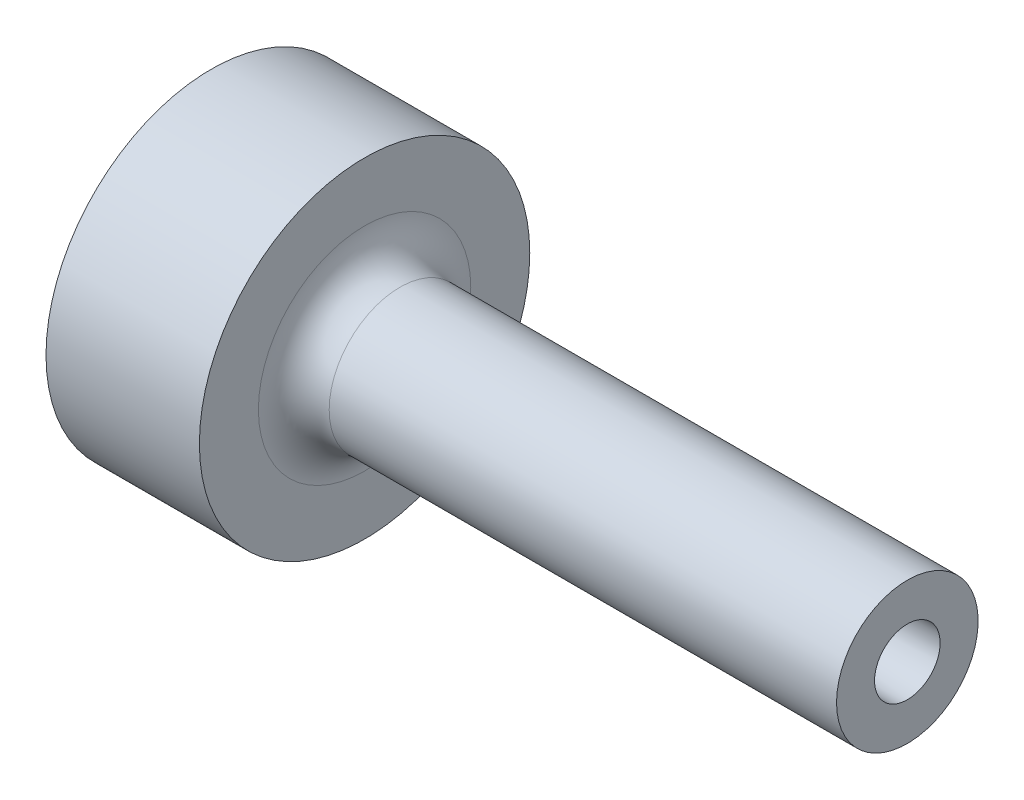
ISO-10303-21;
HEADER;
FILE_DESCRIPTION(('STEP AP214'),'2;1');
FILE_NAME('part.step','',(''),(''),'','','');
FILE_SCHEMA(('AUTOMOTIVE_DESIGN { 1 0 10303 214 1 1 1 1 }'));
ENDSEC;
DATA;
#1=APPLICATION_CONTEXT('core data for automotive mechanical design processes');
#2=APPLICATION_PROTOCOL_DEFINITION('international standard','automotive_design',2000,#1);
#3=PRODUCT_CONTEXT('',#1,'mechanical');
#4=PRODUCT('Part','Part','',(#3));
#5=PRODUCT_RELATED_PRODUCT_CATEGORY('part','',(#4));
#6=PRODUCT_DEFINITION_FORMATION('','',#4);
#7=PRODUCT_DEFINITION_CONTEXT('part definition',#1,'design');
#8=PRODUCT_DEFINITION('design','',#6,#7);
#9=PRODUCT_DEFINITION_SHAPE('','',#8);
#10=(LENGTH_UNIT() NAMED_UNIT(*) SI_UNIT(.MILLI.,.METRE.));
#11=(NAMED_UNIT(*) PLANE_ANGLE_UNIT() SI_UNIT($,.RADIAN.));
#12=(NAMED_UNIT(*) SI_UNIT($,.STERADIAN.) SOLID_ANGLE_UNIT());
#13=UNCERTAINTY_MEASURE_WITH_UNIT(LENGTH_MEASURE(1.E-05),#10,'distance_accuracy_value','');
#14=(GEOMETRIC_REPRESENTATION_CONTEXT(3) GLOBAL_UNCERTAINTY_ASSIGNED_CONTEXT((#13)) GLOBAL_UNIT_ASSIGNED_CONTEXT((#10,
#11,#12)) REPRESENTATION_CONTEXT('',''));
#15=CARTESIAN_POINT('',(0.,0.,0.));
#16=DIRECTION('',(0.,0.,1.));
#17=DIRECTION('',(1.,0.,0.));
#18=AXIS2_PLACEMENT_3D('',#15,#16,#17);
#19=CARTESIAN_POINT('',(0.,0.,0.));
#20=DIRECTION('',(-1.,0.,0.));
#21=DIRECTION('',(0.,0.,1.));
#22=AXIS2_PLACEMENT_3D('',#19,#20,#21);
#23=CYLINDRICAL_SURFACE('',#22,14.);
#24=CARTESIAN_POINT('',(13.,0.,0.));
#25=DIRECTION('',(-1.,0.,0.));
#26=DIRECTION('',(0.,0.,1.));
#27=AXIS2_PLACEMENT_3D('',#24,#25,#26);
#28=CIRCLE('',#27,14.);
#29=CARTESIAN_POINT('',(13.,0.,14.));
#30=VERTEX_POINT('',#29);
#31=EDGE_CURVE('E89',#30,#30,#28,.T.);
#32=ORIENTED_EDGE('',*,*,#31,.T.);
#33=EDGE_LOOP('',(#32));
#34=FACE_BOUND('',#33,.T.);
#35=CARTESIAN_POINT('',(0.,0.,0.));
#36=DIRECTION('',(-1.,0.,0.));
#37=DIRECTION('',(0.,0.,1.));
#38=AXIS2_PLACEMENT_3D('',#35,#36,#37);
#39=CIRCLE('',#38,14.);
#40=CARTESIAN_POINT('',(0.,0.,14.));
#41=VERTEX_POINT('',#40);
#42=EDGE_CURVE('E84',#41,#41,#39,.T.);
#43=ORIENTED_EDGE('',*,*,#42,.F.);
#44=EDGE_LOOP('',(#43));
#45=FACE_BOUND('',#44,.T.);
#46=CARTESIAN_POINT('',(6.5,-13.856406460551,-2.));
#47=CARTESIAN_POINT('',(6.61172417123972,-13.8564082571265,-1.99999534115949));
#48=CARTESIAN_POINT('',(6.72351471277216,-13.8577723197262,-1.99060664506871));
#49=CARTESIAN_POINT('',(6.9439746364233,-13.8630779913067,-1.95330740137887));
#50=CARTESIAN_POINT('',(7.05264079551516,-13.8670221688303,-1.92537839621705));
#51=CARTESIAN_POINT('',(7.26362870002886,-13.8770324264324,-1.85184738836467));
#52=CARTESIAN_POINT('',(7.36595507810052,-13.8830969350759,-1.80625847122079));
#53=CARTESIAN_POINT('',(7.56148972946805,-13.8966626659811,-1.69873175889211));
#54=CARTESIAN_POINT('',(7.65469934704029,-13.9041636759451,-1.63679637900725));
#55=CARTESIAN_POINT('',(7.83004829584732,-13.9198182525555,-1.49785346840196));
#56=CARTESIAN_POINT('',(7.91211171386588,-13.9279757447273,-1.42075056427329));
#57=CARTESIAN_POINT('',(8.06218155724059,-13.9439890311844,-1.25386707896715));
#58=CARTESIAN_POINT('',(8.13018723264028,-13.9518448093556,-1.16408582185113));
#59=CARTESIAN_POINT('',(8.25048909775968,-13.9664103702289,-0.973910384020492));
#60=CARTESIAN_POINT('',(8.30271571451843,-13.9731150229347,-0.873471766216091));
#61=CARTESIAN_POINT('',(8.38953073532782,-13.9845795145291,-0.665136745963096));
#62=CARTESIAN_POINT('',(8.4241199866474,-13.9893394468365,-0.557240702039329));
#63=CARTESIAN_POINT('',(8.47444920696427,-13.9963505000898,-0.337834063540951));
#64=CARTESIAN_POINT('',(8.49031606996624,-13.9986185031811,-0.226353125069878));
#65=CARTESIAN_POINT('',(8.5031438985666,-14.0004479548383,-0.00228956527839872));
#66=CARTESIAN_POINT('',(8.50010582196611,-14.0000095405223,0.110292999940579));
#67=CARTESIAN_POINT('',(8.47531062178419,-13.9964890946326,0.33249899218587));
#68=CARTESIAN_POINT('',(8.45369000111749,-13.9934263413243,0.442137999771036));
#69=CARTESIAN_POINT('',(8.39255744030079,-13.9850228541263,0.656215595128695));
#70=CARTESIAN_POINT('',(8.3530450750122,-13.9796820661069,0.760654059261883));
#71=CARTESIAN_POINT('',(8.25710925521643,-13.9672894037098,0.961781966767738));
#72=CARTESIAN_POINT('',(8.20062784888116,-13.9602316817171,1.05844339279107));
#73=CARTESIAN_POINT('',(8.07239950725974,-13.9451926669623,1.24096782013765));
#74=CARTESIAN_POINT('',(8.00065165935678,-13.9372113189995,1.32683017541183));
#75=CARTESIAN_POINT('',(7.843165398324,-13.921132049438,1.48612299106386));
#76=CARTESIAN_POINT('',(7.75730786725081,-13.9130337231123,1.55943569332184));
#77=CARTESIAN_POINT('',(7.57444547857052,-13.8977029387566,1.69062989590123));
#78=CARTESIAN_POINT('',(7.47744056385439,-13.890470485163,1.74851131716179));
#79=CARTESIAN_POINT('',(7.27491971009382,-13.8776905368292,1.84721301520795));
#80=CARTESIAN_POINT('',(7.1693981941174,-13.8721441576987,1.88802200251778));
#81=CARTESIAN_POINT('',(6.95290242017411,-13.8633846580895,1.9513062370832));
#82=CARTESIAN_POINT('',(6.84192850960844,-13.8601713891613,1.97378265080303));
#83=CARTESIAN_POINT('',(6.61872346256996,-13.8564698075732,1.99960390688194));
#84=CARTESIAN_POINT('',(6.50651197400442,-13.8559577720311,2.00311531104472));
#85=CARTESIAN_POINT('',(6.28310219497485,-13.8576537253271,1.9913480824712));
#86=CARTESIAN_POINT('',(6.17190387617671,-13.8598616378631,1.9760699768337));
#87=CARTESIAN_POINT('',(5.95418781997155,-13.8667269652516,1.92729837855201));
#88=CARTESIAN_POINT('',(5.84765127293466,-13.8713733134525,1.8938871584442));
#89=CARTESIAN_POINT('',(5.6416912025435,-13.8825829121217,1.80988306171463));
#90=CARTESIAN_POINT('',(5.54226800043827,-13.8891462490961,1.75928940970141));
#91=CARTESIAN_POINT('',(5.35260812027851,-13.9035064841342,1.64195360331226));
#92=CARTESIAN_POINT('',(5.26243903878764,-13.911311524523,1.57510320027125));
#93=CARTESIAN_POINT('',(5.09454027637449,-13.9272509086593,1.42730277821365));
#94=CARTESIAN_POINT('',(5.01681123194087,-13.9353852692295,1.34635203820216));
#95=CARTESIAN_POINT('',(4.8754047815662,-13.9511405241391,1.17191708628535));
#96=CARTESIAN_POINT('',(4.81183747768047,-13.9587570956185,1.07834317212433));
#97=CARTESIAN_POINT('',(4.70132443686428,-13.972552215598,0.881748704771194));
#98=CARTESIAN_POINT('',(4.65437828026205,-13.9787308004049,0.778728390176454));
#99=CARTESIAN_POINT('',(4.57861788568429,-13.9889347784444,0.566515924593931));
#100=CARTESIAN_POINT('',(4.54974241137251,-13.9929674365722,0.457345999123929));
#101=CARTESIAN_POINT('',(4.51074453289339,-13.9984555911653,0.235645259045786));
#102=CARTESIAN_POINT('',(4.50062101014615,-13.9999112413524,0.123114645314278));
#103=CARTESIAN_POINT('',(4.49943976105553,-14.0000800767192,-0.101043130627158));
#104=CARTESIAN_POINT('',(4.50821318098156,-13.998817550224,-0.212669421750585));
#105=CARTESIAN_POINT('',(4.54421615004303,-13.9937406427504,-0.432842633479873));
#106=CARTESIAN_POINT('',(4.57144565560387,-13.989926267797,-0.541389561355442));
#107=CARTESIAN_POINT('',(4.6435299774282,-13.9801722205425,-0.752283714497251));
#108=CARTESIAN_POINT('',(4.68837418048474,-13.9742338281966,-0.854634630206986));
#109=CARTESIAN_POINT('',(4.79439714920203,-13.960885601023,-1.05038570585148));
#110=CARTESIAN_POINT('',(4.8555763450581,-13.9534757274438,-1.14378562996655));
#111=CARTESIAN_POINT('',(4.99314771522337,-13.9379304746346,-1.31984194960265));
#112=CARTESIAN_POINT('',(5.06966490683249,-13.9297894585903,-1.40240016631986));
#113=CARTESIAN_POINT('',(5.2354775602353,-13.9137422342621,-1.55356716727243));
#114=CARTESIAN_POINT('',(5.32477602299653,-13.9058360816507,-1.6221726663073));
#115=CARTESIAN_POINT('',(5.51414543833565,-13.8911108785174,-1.74379523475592));
#116=CARTESIAN_POINT('',(5.61426869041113,-13.8842975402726,-1.79673154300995));
#117=CARTESIAN_POINT('',(5.82203229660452,-13.8725962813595,-1.88495902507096));
#118=CARTESIAN_POINT('',(5.92966459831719,-13.8677063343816,-1.92026877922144));
#119=CARTESIAN_POINT('',(6.11483642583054,-13.8615529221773,-1.96409255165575));
#120=CARTESIAN_POINT('',(6.19122433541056,-13.859633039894,-1.97753762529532));
#121=CARTESIAN_POINT('',(6.34506419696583,-13.857059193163,-1.99549291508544));
#122=CARTESIAN_POINT('',(6.42251613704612,-13.8564052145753,-2.00000323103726));
#123=CARTESIAN_POINT('',(6.5,-13.856406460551,-2.));
#124=B_SPLINE_CURVE_WITH_KNOTS('',3,(#46,#47,#48,#49,#50,#51,#52,#53,#54,#55,#56,#57,#58,#59,
#60,#61,#62,#63,#64,#65,#66,#67,#68,#69,#70,#71,#72,#73,#74,#75,#76,#77,#78,#79,#80,#81,#82,#83,
#84,#85,#86,#87,#88,#89,#90,#91,#92,#93,#94,#95,#96,#97,#98,#99,#100,#101,#102,#103,#104,#105,
#106,#107,#108,#109,#110,#111,#112,#113,#114,#115,#116,#117,#118,#119,#120,#121,#122,#123),
.UNSPECIFIED.,.T.,.F.,(4,2,2,2,2,2,2,2,2,2,2,2,2,2,2,2,2,2,2,2,2,2,2,2,2,2,2,2,2,2,2,2,2,2,2,2,
2,2,4),(0.,0.334889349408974,0.670112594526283,1.00508792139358,1.34001378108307,
1.6771171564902,2.01423851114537,2.35282530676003,2.6913958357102,3.02765822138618,
3.36390357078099,3.69769984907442,4.03150405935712,4.36646147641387,4.70143892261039,
5.03940517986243,5.37737316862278,5.7155642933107,6.05373389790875,6.3889286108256,
6.72411392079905,7.05779100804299,7.39148315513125,7.72746121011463,8.06345644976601,
8.40197921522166,8.74049343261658,9.07785422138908,9.41519488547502,9.74953375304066,
10.083871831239,10.4180087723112,10.7521545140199,11.0891434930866,11.426211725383,
11.7649881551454,12.103406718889,12.3356645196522,12.5679197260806),.UNSPECIFIED.);
#125=CARTESIAN_POINT('',(6.5,-13.856406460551,-2.));
#126=VERTEX_POINT('',#125);
#127=EDGE_CURVE('E10',#126,#126,#124,.T.);
#128=ORIENTED_EDGE('',*,*,#127,.F.);
#129=EDGE_LOOP('',(#128));
#130=FACE_BOUND('',#129,.T.);
#131=ADVANCED_FACE('F16',(#34,#45,#130),#23,.T.);
#132=CARTESIAN_POINT('',(0.,0.,0.));
#133=DIRECTION('',(1.,0.,0.));
#134=DIRECTION('',(0.,0.,-1.));
#135=AXIS2_PLACEMENT_3D('',#132,#133,#134);
#136=CONICAL_SURFACE('',#135,1.75,0.0174532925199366);
#137=CARTESIAN_POINT('',(59.,0.,0.));
#138=DIRECTION('',(-1.,0.,0.));
#139=DIRECTION('',(0.,0.,1.));
#140=AXIS2_PLACEMENT_3D('',#137,#138,#139);
#141=CIRCLE('',#140,2.77984883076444);
#142=CARTESIAN_POINT('',(59.,0.,2.77984883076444));
#143=VERTEX_POINT('',#142);
#144=EDGE_CURVE('E81',#143,#143,#141,.T.);
#145=ORIENTED_EDGE('',*,*,#144,.F.);
#146=EDGE_LOOP('',(#145));
#147=FACE_BOUND('',#146,.T.);
#148=CARTESIAN_POINT('',(0.856894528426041,0.,0.));
#149=DIRECTION('',(-1.,0.,0.));
#150=DIRECTION('',(0.,0.,1.));
#151=AXIS2_PLACEMENT_3D('',#148,#149,#150);
#152=CIRCLE('',#151,1.76495714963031);
#153=CARTESIAN_POINT('',(0.856894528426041,0.,1.76495714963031));
#154=VERTEX_POINT('',#153);
#155=EDGE_CURVE('E94',#154,#154,#152,.F.);
#156=ORIENTED_EDGE('',*,*,#155,.F.);
#157=EDGE_LOOP('',(#156));
#158=FACE_BOUND('',#157,.T.);
#159=ADVANCED_FACE('F45',(#147,#158),#136,.F.);
#160=CARTESIAN_POINT('',(16.,0.,0.));
#161=DIRECTION('',(-1.,0.,0.));
#162=DIRECTION('',(0.,0.,1.));
#163=AXIS2_PLACEMENT_3D('',#160,#161,#162);
#164=TOROIDAL_SURFACE('',#163,9.,3.);
#165=CARTESIAN_POINT('',(13.,0.,0.));
#166=DIRECTION('',(-1.,0.,0.));
#167=DIRECTION('',(0.,0.,1.));
#168=AXIS2_PLACEMENT_3D('',#165,#166,#167);
#169=CIRCLE('',#168,9.);
#170=CARTESIAN_POINT('',(13.,0.,9.));
#171=VERTEX_POINT('',#170);
#172=EDGE_CURVE('E91',#171,#171,#169,.T.);
#173=ORIENTED_EDGE('',*,*,#172,.F.);
#174=EDGE_LOOP('',(#173));
#175=FACE_BOUND('',#174,.T.);
#176=CARTESIAN_POINT('',(16.,0.,0.));
#177=DIRECTION('',(-1.,0.,0.));
#178=DIRECTION('',(0.,0.,1.));
#179=AXIS2_PLACEMENT_3D('',#176,#177,#178);
#180=CIRCLE('',#179,6.);
#181=CARTESIAN_POINT('',(16.,0.,6.));
#182=VERTEX_POINT('',#181);
#183=EDGE_CURVE('E28',#182,#182,#180,.T.);
#184=ORIENTED_EDGE('',*,*,#183,.T.);
#185=EDGE_LOOP('',(#184));
#186=FACE_BOUND('',#185,.T.);
#187=ADVANCED_FACE('F18',(#175,#186),#164,.F.);
#188=CARTESIAN_POINT('',(0.,0.,0.));
#189=DIRECTION('',(-1.,0.,0.));
#190=DIRECTION('',(0.,0.,1.));
#191=AXIS2_PLACEMENT_3D('',#188,#189,#190);
#192=CYLINDRICAL_SURFACE('',#191,6.);
#193=ORIENTED_EDGE('',*,*,#183,.F.);
#194=EDGE_LOOP('',(#193));
#195=FACE_BOUND('',#194,.T.);
#196=CARTESIAN_POINT('',(59.,0.,0.));
#197=DIRECTION('',(-1.,0.,0.));
#198=DIRECTION('',(0.,0.,1.));
#199=AXIS2_PLACEMENT_3D('',#196,#197,#198);
#200=CIRCLE('',#199,6.);
#201=CARTESIAN_POINT('',(59.,0.,6.));
#202=VERTEX_POINT('',#201);
#203=EDGE_CURVE('E80',#202,#202,#200,.T.);
#204=ORIENTED_EDGE('',*,*,#203,.T.);
#205=EDGE_LOOP('',(#204));
#206=FACE_BOUND('',#205,.T.);
#207=ADVANCED_FACE('F66',(#195,#206),#192,.T.);
#208=CARTESIAN_POINT('',(59.,6.,0.));
#209=DIRECTION('',(-1.,0.,0.));
#210=DIRECTION('',(0.,0.,1.));
#211=AXIS2_PLACEMENT_3D('',#208,#209,#210);
#212=PLANE('',#211);
#213=ORIENTED_EDGE('',*,*,#203,.F.);
#214=EDGE_LOOP('',(#213));
#215=FACE_BOUND('',#214,.T.);
#216=ORIENTED_EDGE('',*,*,#144,.T.);
#217=EDGE_LOOP('',(#216));
#218=FACE_BOUND('',#217,.T.);
#219=ADVANCED_FACE('F62',(#215,#218),#212,.F.);
#220=CARTESIAN_POINT('',(0.,1.75,0.));
#221=DIRECTION('',(1.,0.,0.));
#222=DIRECTION('',(0.,0.,-1.));
#223=AXIS2_PLACEMENT_3D('',#220,#221,#222);
#224=PLANE('',#223);
#225=CARTESIAN_POINT('',(0.,0.,0.));
#226=DIRECTION('',(-1.,0.,0.));
#227=DIRECTION('',(0.,0.,1.));
#228=AXIS2_PLACEMENT_3D('',#225,#226,#227);
#229=CIRCLE('',#228,5.);
#230=CARTESIAN_POINT('',(0.,0.,5.));
#231=VERTEX_POINT('',#230);
#232=EDGE_CURVE('E97',#231,#231,#229,.T.);
#233=ORIENTED_EDGE('',*,*,#232,.F.);
#234=EDGE_LOOP('',(#233));
#235=FACE_BOUND('',#234,.T.);
#236=ORIENTED_EDGE('',*,*,#42,.T.);
#237=EDGE_LOOP('',(#236));
#238=FACE_BOUND('',#237,.T.);
#239=ADVANCED_FACE('F60',(#235,#238),#224,.F.);
#240=CARTESIAN_POINT('',(13.,14.,0.));
#241=DIRECTION('',(-1.,0.,0.));
#242=DIRECTION('',(0.,0.,1.));
#243=AXIS2_PLACEMENT_3D('',#240,#241,#242);
#244=PLANE('',#243);
#245=ORIENTED_EDGE('',*,*,#31,.F.);
#246=EDGE_LOOP('',(#245));
#247=FACE_BOUND('',#246,.T.);
#248=ORIENTED_EDGE('',*,*,#172,.T.);
#249=EDGE_LOOP('',(#248));
#250=FACE_BOUND('',#249,.T.);
#251=ADVANCED_FACE('F58',(#247,#250),#244,.F.);
#252=CARTESIAN_POINT('',(-14.4672767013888,0.,0.));
#253=DIRECTION('',(-1.,0.,0.));
#254=DIRECTION('',(0.,0.,1.));
#255=AXIS2_PLACEMENT_3D('',#252,#253,#254);
#256=DEGENERATE_TOROIDAL_SURFACE('',#255,0.56308411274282,15.5,.F.);
#257=ORIENTED_EDGE('',*,*,#232,.T.);
#258=EDGE_LOOP('',(#257));
#259=FACE_BOUND('',#258,.T.);
#260=ORIENTED_EDGE('',*,*,#155,.T.);
#261=EDGE_LOOP('',(#260));
#262=FACE_BOUND('',#261,.T.);
#263=ADVANCED_FACE('F41',(#259,#262),#256,.T.);
#264=CARTESIAN_POINT('',(6.5,-14.,0.));
#265=DIRECTION('',(0.,-1.,0.));
#266=DIRECTION('',(0.,0.,-1.));
#267=AXIS2_PLACEMENT_3D('',#264,#265,#266);
#268=CYLINDRICAL_SURFACE('',#267,2.);
#269=CARTESIAN_POINT('',(6.5,-8.,0.));
#270=DIRECTION('',(0.,-1.,0.));
#271=DIRECTION('',(0.,0.,-1.));
#272=AXIS2_PLACEMENT_3D('',#269,#270,#271);
#273=CIRCLE('',#272,2.);
#274=CARTESIAN_POINT('',(6.5,-8.,-2.));
#275=VERTEX_POINT('',#274);
#276=EDGE_CURVE('E100',#275,#275,#273,.T.);
#277=ORIENTED_EDGE('',*,*,#276,.F.);
#278=EDGE_LOOP('',(#277));
#279=FACE_BOUND('',#278,.T.);
#280=ORIENTED_EDGE('',*,*,#127,.T.);
#281=EDGE_LOOP('',(#280));
#282=FACE_BOUND('',#281,.T.);
#283=ADVANCED_FACE('F33',(#279,#282),#268,.F.);
#284=CARTESIAN_POINT('',(6.5,-6.84529946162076,0.));
#285=DIRECTION('',(0.,-1.,0.));
#286=DIRECTION('',(0.,0.,-1.));
#287=AXIS2_PLACEMENT_3D('',#284,#285,#286);
#288=CONICAL_SURFACE('',#287,0.,1.0471975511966);
#289=ORIENTED_EDGE('',*,*,#276,.T.);
#290=EDGE_LOOP('',(#289));
#291=FACE_BOUND('',#290,.T.);
#292=CARTESIAN_POINT('',(6.5,-6.84529946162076,0.));
#293=VERTEX_POINT('',#292);
#294=VERTEX_LOOP('',#293);
#295=FACE_BOUND('',#294,.T.);
#296=ADVANCED_FACE('F31',(#291,#295),#288,.F.);
#297=CLOSED_SHELL('',(#131,#159,#187,#207,#219,#239,#251,#263,#283,#296));
#298=MANIFOLD_SOLID_BREP('B1',#297);
#299=ADVANCED_BREP_SHAPE_REPRESENTATION('',(#18,#298),#14);
#300=SHAPE_DEFINITION_REPRESENTATION(#9,#299);
ENDSEC;
END-ISO-10303-21;
